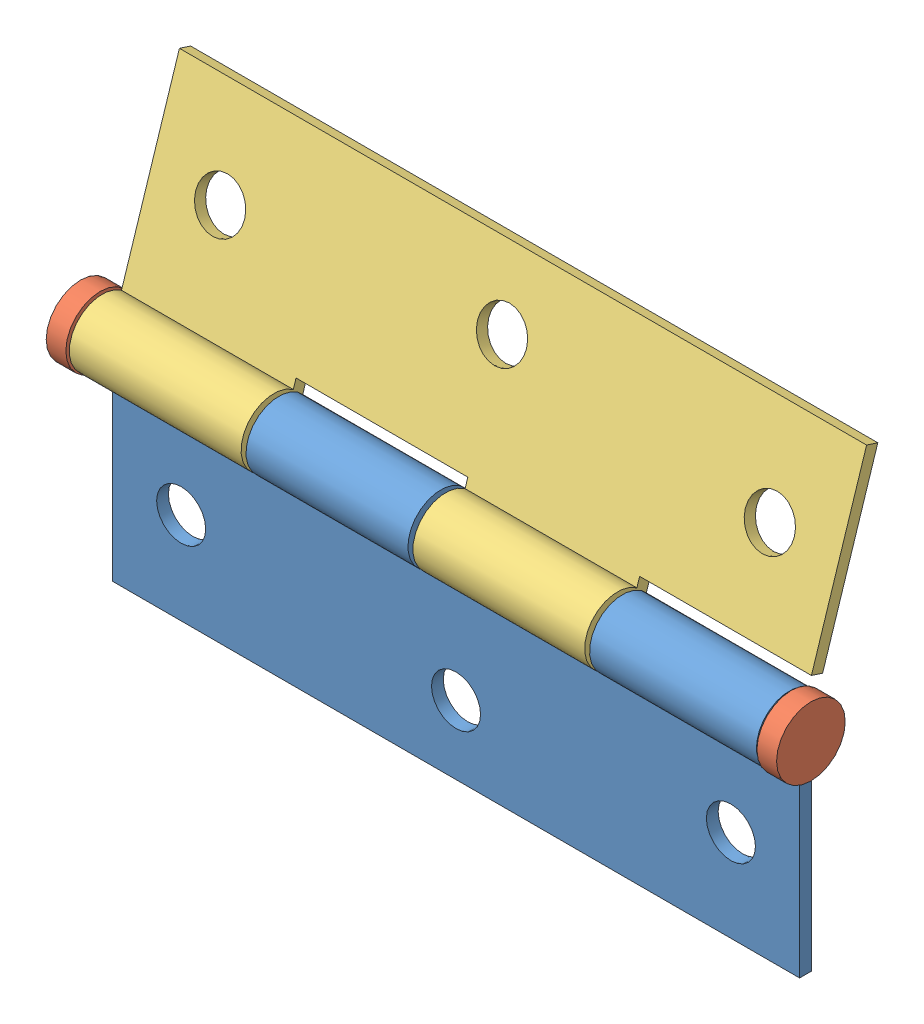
SolidWorks assembly Z-Door hinge-LAP.sldasm, configuration Default (file format 11000). Lengths in mm.
Overall size (74.4 44.95 14.28).
3 component instances, 3 part files, 2 mates.
Components (placement in the parent):
- Z-Door hinge-1-1: Z-Door hinge-1.sldprt [Default] at origin size (70 25.85 6.7)
- Z-Door hinge-2-1: Z-Door hinge-2.sldprt [Default] at origin size (74.4 7 7)
- Z-Door hinge-3-1: Z-Door hinge-3.sldprt [Default] at (0 -8.2033 1.2838) x (1 0 0) z (0 0.305506 0.95219) size (70 25.85 6.7)
Mates (geometry in assembly coordinates):
- Concentric1: concentric: cylinder of Z-Door hinge-2-1 through (-40.4912 -3.85 2.25) axis (1 0 0) radius 1.8; cylinder of Z-Door hinge-3-1 through (35 -3.85 2.25) axis (-1 0 0) radius 2
- Coincident1: coincident: plane of Z-Door hinge-3-1 through (0 -8.2033 1.2838) normal (1 0 0); plane of assembly through (0 0 0) normal (1 0 0)
